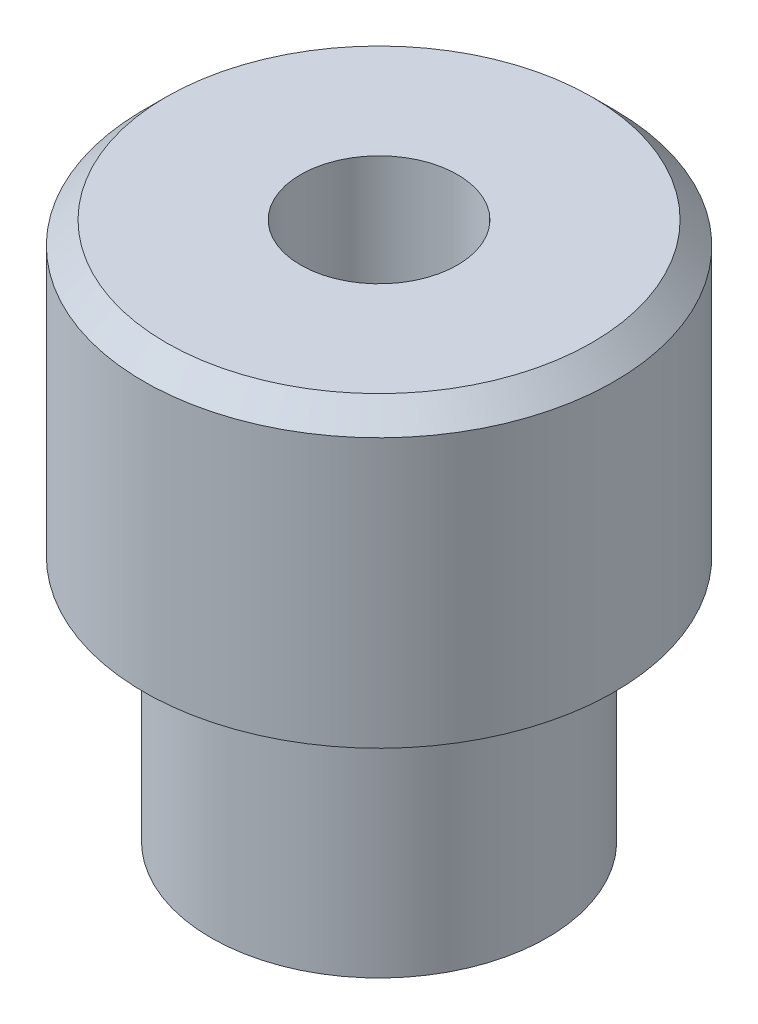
from build123d import *

# Parameters (mm, degrees)
SKICA1_R                 = 7.5
P_IDAT_VYSUNUT_M1_DEPTH  = 11
SKICA2_R                 = 10.5
P_IDAT_VYSUNUT_M2_DEPTH  = 13
ZKOSEN_1_SIZE            = 1.5
ZKOSEN_1_SIZE2           = 2.5
ZKOSEN_2_SIZE            = 1
SKICA3_R                 = 3.5
ODEBRAT_VYSUNUT_M1_DEPTH = 29.222331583


with BuildPart() as part:
    # Skica1 → P_idat vysunut_m1 (new body)
    with BuildSketch(Plane(origin=(0, 0, 0), x_dir=(1, 0, 0), z_dir=(0, 1, 0))):
        with Locations(Location((0, 0, 0), (0, 0, 270))):
            Circle(SKICA1_R)
    extrude(amount=P_IDAT_VYSUNUT_M1_DEPTH)

    # Skica2 → P_idat vysunut_m2 (add)
    with BuildSketch(Plane(origin=(0, 11, 0), x_dir=(1, 0, 0), z_dir=(0, 1, 0))):
        with Locations(Location((0, 0, 0), (0, 0, 90))):
            Circle(SKICA2_R)
    extrude(amount=P_IDAT_VYSUNUT_M2_DEPTH)

    # Zkosen_1
    zkosen_1_edges = [part.edges().sort_by_distance(p)[0] for p in [
        (0, 11, -7.5),
    ]]
    zkosen_1_side = [part.faces().sort_by_distance(p)[0] for p in [
        (0, 5.5, -7.5),
    ]]
    chamfer(zkosen_1_edges, length=ZKOSEN_1_SIZE, length2=ZKOSEN_1_SIZE2, reference=zkosen_1_side[0])

    # Zkosen_2
    zkosen_2_edges = [part.edges().sort_by_distance(p)[0] for p in [
        (0, 24, 10.5),
    ]]
    chamfer(zkosen_2_edges, length=ZKOSEN_2_SIZE)

    # Skica3 → Odebrat vysunut_m1 (cut, through all)
    with BuildSketch(Plane(origin=(0, 24, 0), x_dir=(1, 0, 0), z_dir=(0, 1, 0))):
        with Locations(Location((0, 0, 0), (0, 0, 270))):
            Circle(SKICA3_R)
    extrude(amount=-ODEBRAT_VYSUNUT_M1_DEPTH, mode=Mode.SUBTRACT)


solid = part.part
